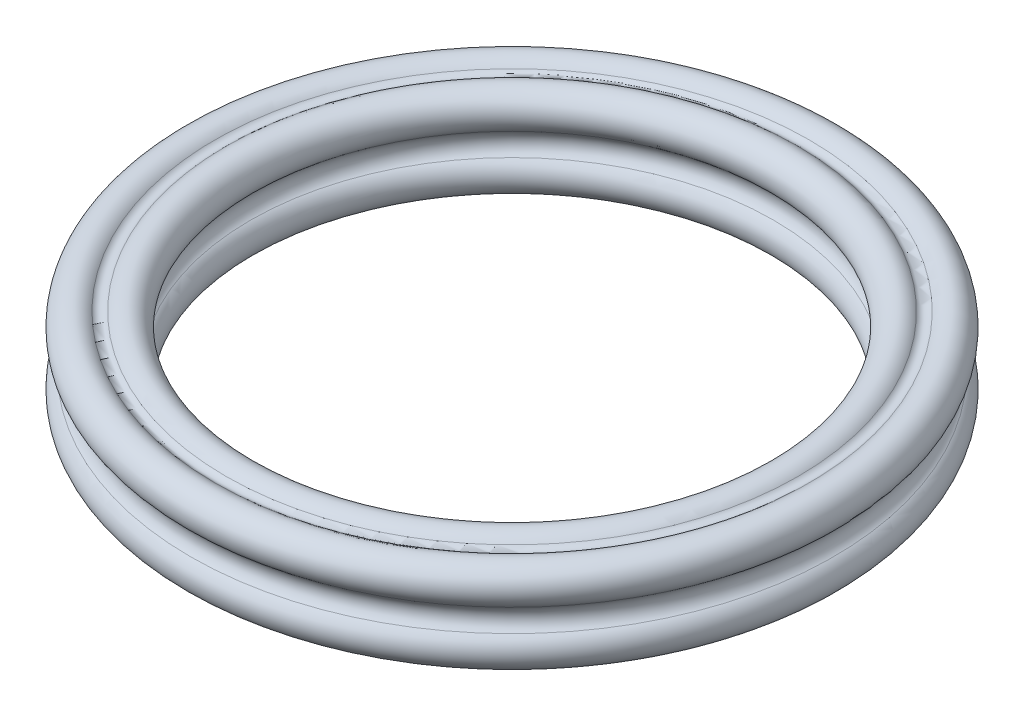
from build123d import *


with BuildPart() as part:
    # Esquisse1 → Base (revolve)
    with BuildSketch(Plane.XY, mode=Mode.PRIVATE) as base_sk:
        with BuildLine():
            ThreePointArc((9.024264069, 1.274264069), (8.141106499, 1.236544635), (8.253990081, 0.359819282))
            ThreePointArc((8.253990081, 0.359819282), (8.440432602, 0), (8.253990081, -0.359819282))
            ThreePointArc((8.253990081, -0.359819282), (8.141106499, -1.236544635), (9.024264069, -1.274264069))
            ThreePointArc((9.024264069, -1.274264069), (9.2, -1.201471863), (9.375735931, -1.274264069))
            ThreePointArc((9.375735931, -1.274264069), (10.258893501, -1.236544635), (10.146009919, -0.359819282))
            ThreePointArc((10.146009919, -0.359819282), (9.959567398, 0), (10.146009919, 0.359819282))
            ThreePointArc((10.146009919, 0.359819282), (10.258893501, 1.236544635), (9.375735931, 1.274264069))
            ThreePointArc((9.375735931, 1.274264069), (9.2, 1.201471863), (9.024264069, 1.274264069))
        make_face()
    revolve(base_sk.sketch.rotate(Axis((0, 4.28, 0), (0, -1, 0)), 90), axis=Axis((0, 4.28, 0), (0, -1, 0)))


solid = part.part
